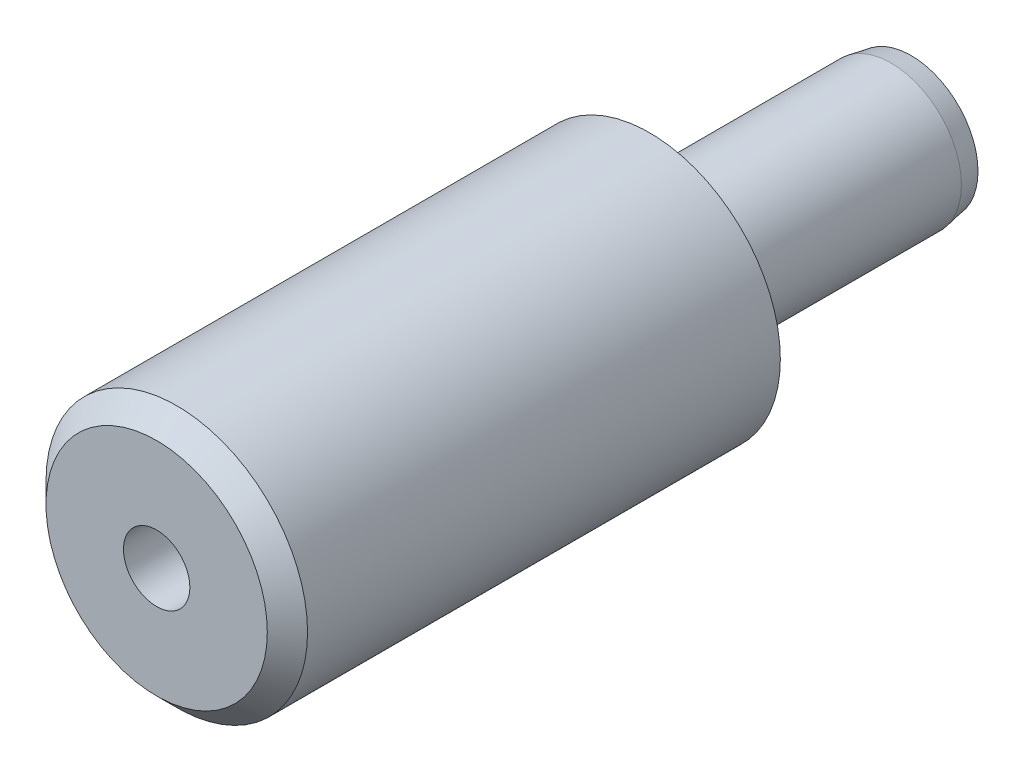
from build123d import *

# Parameters (mm, degrees)
SHOULDERFV_W                        = 6.5
SHOULDERFV_H                        = 24.5
M4X0_7_BOTTOMING_TAPPED_HOLE1_D     = 3.3
M4X0_7_BOTTOMING_TAPPED_HOLE1_DEPTH = 13
M4X0_7_BOTTOMING_TAPPED_HOLE1_TIP   = 0.991420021
FILLET1_R                           = 0.8
CHAMFER1_SIZE                       = 1


with BuildPart() as part:
    # ShoulderFV → Revolve1 (revolve)
    with BuildSketch(Plane(origin=(0, 0, 0), x_dir=(1, 0, 0), z_dir=(0, 1, 0))):
        with Locations((3.25, -12.75)):
            Rectangle(SHOULDERFV_W, SHOULDERFV_H)
    revolve(axis=Axis((0, 0, 0.5), (0, 0, -1)))

    # PinFV → Revolve2 (revolve)
    with BuildSketch(Plane(origin=(0, 0, 0), x_dir=(1, 0, 0), z_dir=(0, 1, 0))):
        Polygon((0, -0.5), (0, 12.5), (3.323673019, 12.5), (3.5, 11.5), (3.5, -0.5), align=None)
    revolve(axis=Axis((0, 0, -12.5), (0, 0, -1)))

    # M4x0.7 Bottoming Tapped Hole1
    with Locations(Plane.XY.offset(25)):
        with Locations((0, 0)):
            Hole(M4X0_7_BOTTOMING_TAPPED_HOLE1_D / 2, depth=M4X0_7_BOTTOMING_TAPPED_HOLE1_DEPTH)
            with Locations((0, 0, -(M4X0_7_BOTTOMING_TAPPED_HOLE1_DEPTH + M4X0_7_BOTTOMING_TAPPED_HOLE1_TIP / 2))):  # 118° drill point
                Cone(0, M4X0_7_BOTTOMING_TAPPED_HOLE1_D / 2, M4X0_7_BOTTOMING_TAPPED_HOLE1_TIP, mode=Mode.SUBTRACT)

    # Fillet1
    fillet1_edges = [part.edges().sort_by_distance(p)[0] for p in [
        (-3.5, 0, 0.5),
    ]]
    fillet(fillet1_edges, radius=FILLET1_R)

    # Chamfer1
    chamfer1_edges = [part.edges().sort_by_distance(p)[0] for p in [
        (-6.5, 0, 25),
    ]]
    chamfer(chamfer1_edges, length=CHAMFER1_SIZE)


solid = part.part
